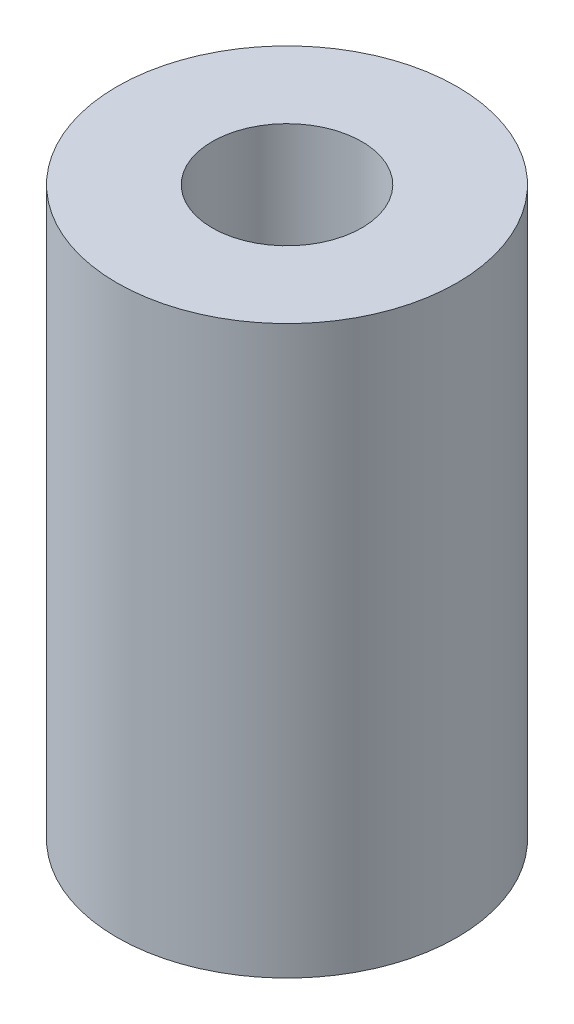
from build123d import *

# Parameters (mm, degrees)
SKETCH1_R           = 7.5
SKETCH1_R_2         = 3.3
BOSS_EXTRUDE1_DEPTH = 25


with BuildPart() as part:
    # Sketch1 → Boss-Extrude1 (new body)
    with BuildSketch(Plane(origin=(0, 0, 0), x_dir=(1, 0, 0), z_dir=(0, 1, 0))):
        with Locations(Location((0, 0, 0), (0, 0, 270))):
            Circle(SKETCH1_R)
        with Locations(Location((0, 0, 0), (0, 0, 270))):
            Circle(SKETCH1_R_2, mode=Mode.SUBTRACT)
    extrude(amount=BOSS_EXTRUDE1_DEPTH)


solid = part.part
